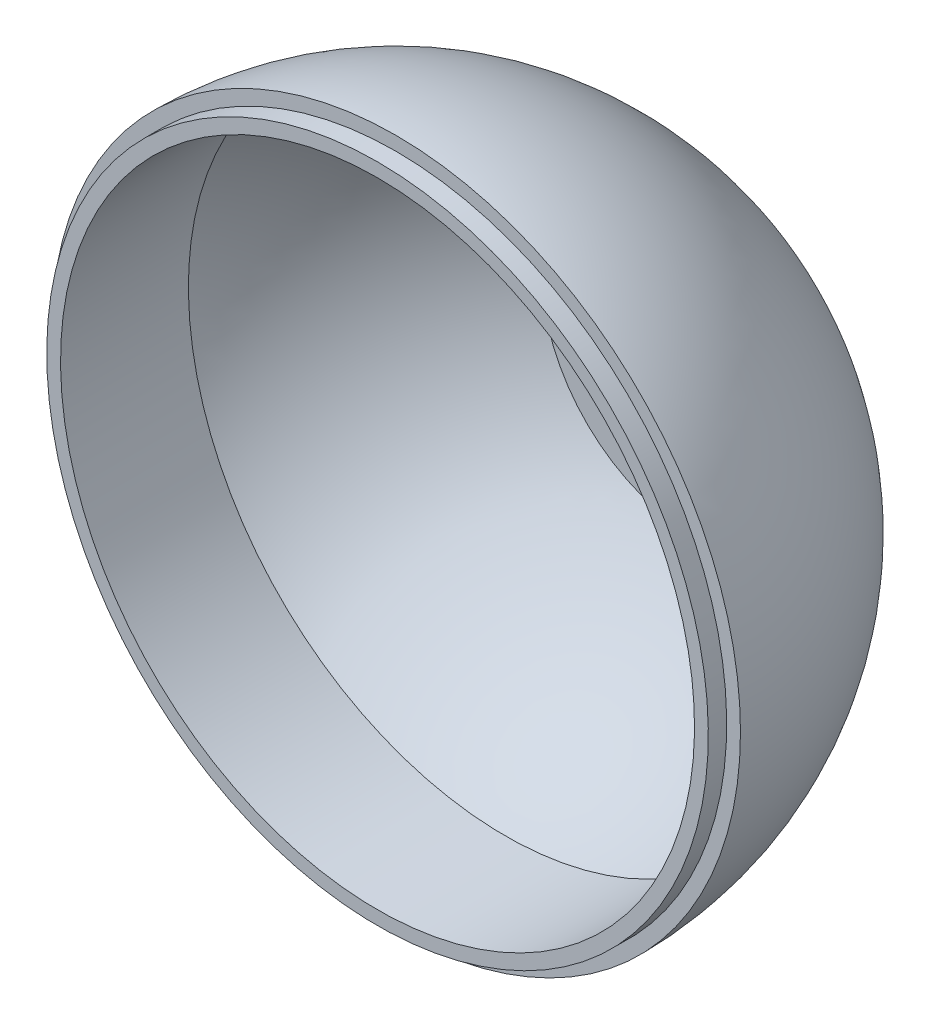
ISO-10303-21;
HEADER;
FILE_DESCRIPTION(('STEP AP214'),'2;1');
FILE_NAME('part.step','',(''),(''),'','','');
FILE_SCHEMA(('AUTOMOTIVE_DESIGN { 1 0 10303 214 1 1 1 1 }'));
ENDSEC;
DATA;
#1=APPLICATION_CONTEXT('core data for automotive mechanical design processes');
#2=APPLICATION_PROTOCOL_DEFINITION('international standard','automotive_design',2000,#1);
#3=PRODUCT_CONTEXT('',#1,'mechanical');
#4=PRODUCT('Part','Part','',(#3));
#5=PRODUCT_RELATED_PRODUCT_CATEGORY('part','',(#4));
#6=PRODUCT_DEFINITION_FORMATION('','',#4);
#7=PRODUCT_DEFINITION_CONTEXT('part definition',#1,'design');
#8=PRODUCT_DEFINITION('design','',#6,#7);
#9=PRODUCT_DEFINITION_SHAPE('','',#8);
#10=(LENGTH_UNIT() NAMED_UNIT(*) SI_UNIT(.MILLI.,.METRE.));
#11=(NAMED_UNIT(*) PLANE_ANGLE_UNIT() SI_UNIT($,.RADIAN.));
#12=(NAMED_UNIT(*) SI_UNIT($,.STERADIAN.) SOLID_ANGLE_UNIT());
#13=UNCERTAINTY_MEASURE_WITH_UNIT(LENGTH_MEASURE(1.E-05),#10,'distance_accuracy_value','');
#14=(GEOMETRIC_REPRESENTATION_CONTEXT(3) GLOBAL_UNCERTAINTY_ASSIGNED_CONTEXT((#13)) GLOBAL_UNIT_ASSIGNED_CONTEXT((#10,
#11,#12)) REPRESENTATION_CONTEXT('',''));
#15=CARTESIAN_POINT('',(0.,0.,0.));
#16=DIRECTION('',(0.,0.,1.));
#17=DIRECTION('',(1.,0.,0.));
#18=AXIS2_PLACEMENT_3D('',#15,#16,#17);
#19=CARTESIAN_POINT('',(0.,0.,-133.001519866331));
#20=DIRECTION('',(0.,0.,-1.));
#21=DIRECTION('',(1.,0.,0.));
#22=AXIS2_PLACEMENT_3D('',#19,#20,#21);
#23=CONICAL_SURFACE('',#22,1.66175,1.02974425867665);
#24=CARTESIAN_POINT('',(0.,0.,-134.));
#25=DIRECTION('',(0.,0.,1.));
#26=DIRECTION('',(1.,0.,0.));
#27=AXIS2_PLACEMENT_3D('',#24,#25,#26);
#28=CIRCLE('',#27,3.3235);
#29=CARTESIAN_POINT('',(3.3235,0.,-134.));
#30=VERTEX_POINT('',#29);
#31=EDGE_CURVE('E10',#30,#30,#28,.T.);
#32=ORIENTED_EDGE('',*,*,#31,.F.);
#33=EDGE_LOOP('',(#32));
#34=FACE_BOUND('',#33,.T.);
#35=CARTESIAN_POINT('',(0.,0.,-132.003039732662));
#36=VERTEX_POINT('',#35);
#37=VERTEX_LOOP('',#36);
#38=FACE_BOUND('',#37,.T.);
#39=ADVANCED_FACE('F15',(#34,#38),#23,.F.);
#40=CARTESIAN_POINT('',(0.,0.,-142.));
#41=DIRECTION('',(0.,0.,-1.));
#42=DIRECTION('',(1.,0.,0.));
#43=AXIS2_PLACEMENT_3D('',#40,#41,#42);
#44=CYLINDRICAL_SURFACE('',#43,3.3235);
#45=CARTESIAN_POINT('',(0.,0.,-149.9631766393));
#46=DIRECTION('',(0.,0.,1.));
#47=DIRECTION('',(1.,0.,0.));
#48=AXIS2_PLACEMENT_3D('',#45,#46,#47);
#49=CIRCLE('',#48,3.3235);
#50=CARTESIAN_POINT('',(-3.3235,0.,-149.9631766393));
#51=VERTEX_POINT('',#50);
#52=EDGE_CURVE('E61',#51,#51,#49,.T.);
#53=ORIENTED_EDGE('',*,*,#52,.F.);
#54=EDGE_LOOP('',(#53));
#55=FACE_BOUND('',#54,.T.);
#56=ORIENTED_EDGE('',*,*,#31,.T.);
#57=EDGE_LOOP('',(#56));
#58=FACE_BOUND('',#57,.T.);
#59=ADVANCED_FACE('F96',(#55,#58),#44,.F.);
#60=CARTESIAN_POINT('',(0.,66.4529909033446,-130.));
#61=DIRECTION('',(0.,0.,1.));
#62=DIRECTION('',(1.,0.,0.));
#63=AXIS2_PLACEMENT_3D('',#60,#61,#62);
#64=PLANE('',#63);
#65=CARTESIAN_POINT('',(0.,0.,-130.));
#66=DIRECTION('',(0.,0.,-1.));
#67=DIRECTION('',(1.,0.,0.));
#68=AXIS2_PLACEMENT_3D('',#65,#66,#67);
#69=CIRCLE('',#68,66.4529909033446);
#70=CARTESIAN_POINT('',(0.,66.4529909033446,-130.));
#71=VERTEX_POINT('',#70);
#72=EDGE_CURVE('E19',#71,#71,#69,.T.);
#73=ORIENTED_EDGE('',*,*,#72,.F.);
#74=EDGE_LOOP('',(#73));
#75=FACE_BOUND('',#74,.T.);
#76=ADVANCED_FACE('F102',(#75),#64,.T.);
#77=CARTESIAN_POINT('',(0.,0.,0.));
#78=DIRECTION('',(0.,0.,1.));
#79=DIRECTION('',(1.,0.,0.));
#80=AXIS2_PLACEMENT_3D('',#77,#78,#79);
#81=SPHERICAL_SURFACE('',#80,146.);
#82=CARTESIAN_POINT('',(0.,0.,-47.665501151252));
#83=DIRECTION('',(0.,0.,-1.));
#84=DIRECTION('',(1.,0.,0.));
#85=AXIS2_PLACEMENT_3D('',#82,#83,#84);
#86=CIRCLE('',#85,138.);
#87=CARTESIAN_POINT('',(0.,138.,-47.665501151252));
#88=VERTEX_POINT('',#87);
#89=EDGE_CURVE('E76',#88,#88,#86,.T.);
#90=ORIENTED_EDGE('',*,*,#89,.F.);
#91=EDGE_LOOP('',(#90));
#92=FACE_BOUND('',#91,.T.);
#93=ORIENTED_EDGE('',*,*,#72,.T.);
#94=EDGE_LOOP('',(#93));
#95=FACE_BOUND('',#94,.T.);
#96=ADVANCED_FACE('F17',(#92,#95),#81,.F.);
#97=CARTESIAN_POINT('',(0.,0.,-19.8327505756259));
#98=DIRECTION('',(0.,0.,1.));
#99=DIRECTION('',(0.,1.,0.));
#100=AXIS2_PLACEMENT_3D('',#97,#98,#99);
#101=CYLINDRICAL_SURFACE('',#100,138.);
#102=CARTESIAN_POINT('',(0.,0.,8.00000000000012));
#103=DIRECTION('',(0.,0.,-1.));
#104=DIRECTION('',(1.,0.,0.));
#105=AXIS2_PLACEMENT_3D('',#102,#103,#104);
#106=CIRCLE('',#105,138.);
#107=CARTESIAN_POINT('',(0.,138.,8.00000000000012));
#108=VERTEX_POINT('',#107);
#109=EDGE_CURVE('E72',#108,#108,#106,.T.);
#110=ORIENTED_EDGE('',*,*,#109,.F.);
#111=EDGE_LOOP('',(#110));
#112=FACE_BOUND('',#111,.T.);
#113=ORIENTED_EDGE('',*,*,#89,.T.);
#114=EDGE_LOOP('',(#113));
#115=FACE_BOUND('',#114,.T.);
#116=ADVANCED_FACE('F109',(#112,#115),#101,.F.);
#117=CARTESIAN_POINT('',(0.,144.,8.00000000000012));
#118=DIRECTION('',(0.,0.,1.));
#119=DIRECTION('',(1.,0.,0.));
#120=AXIS2_PLACEMENT_3D('',#117,#118,#119);
#121=PLANE('',#120);
#122=CARTESIAN_POINT('',(0.,0.,8.00000000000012));
#123=DIRECTION('',(0.,0.,-1.));
#124=DIRECTION('',(1.,0.,0.));
#125=AXIS2_PLACEMENT_3D('',#122,#123,#124);
#126=CIRCLE('',#125,144.);
#127=CARTESIAN_POINT('',(0.,144.,8.00000000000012));
#128=VERTEX_POINT('',#127);
#129=EDGE_CURVE('E69',#128,#128,#126,.T.);
#130=ORIENTED_EDGE('',*,*,#129,.F.);
#131=EDGE_LOOP('',(#130));
#132=FACE_BOUND('',#131,.T.);
#133=ORIENTED_EDGE('',*,*,#109,.T.);
#134=EDGE_LOOP('',(#133));
#135=FACE_BOUND('',#134,.T.);
#136=ADVANCED_FACE('F93',(#132,#135),#121,.T.);
#137=CARTESIAN_POINT('',(0.,0.,4.00000000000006));
#138=DIRECTION('',(0.,0.,1.));
#139=DIRECTION('',(0.,1.,0.));
#140=AXIS2_PLACEMENT_3D('',#137,#138,#139);
#141=CYLINDRICAL_SURFACE('',#140,144.);
#142=CARTESIAN_POINT('',(0.,0.,0.));
#143=DIRECTION('',(0.,0.,-1.));
#144=DIRECTION('',(1.,0.,0.));
#145=AXIS2_PLACEMENT_3D('',#142,#143,#144);
#146=CIRCLE('',#145,144.);
#147=CARTESIAN_POINT('',(0.,144.,0.));
#148=VERTEX_POINT('',#147);
#149=EDGE_CURVE('E52',#148,#148,#146,.T.);
#150=ORIENTED_EDGE('',*,*,#149,.F.);
#151=EDGE_LOOP('',(#150));
#152=FACE_BOUND('',#151,.T.);
#153=ORIENTED_EDGE('',*,*,#129,.T.);
#154=EDGE_LOOP('',(#153));
#155=FACE_BOUND('',#154,.T.);
#156=ADVANCED_FACE('F84',(#152,#155),#141,.T.);
#157=CARTESIAN_POINT('',(0.,150.,0.));
#158=DIRECTION('',(0.,0.,1.));
#159=DIRECTION('',(1.,0.,0.));
#160=AXIS2_PLACEMENT_3D('',#157,#158,#159);
#161=PLANE('',#160);
#162=CARTESIAN_POINT('',(0.,0.,0.));
#163=DIRECTION('',(0.,0.,-1.));
#164=DIRECTION('',(1.,0.,0.));
#165=AXIS2_PLACEMENT_3D('',#162,#163,#164);
#166=CIRCLE('',#165,150.);
#167=CARTESIAN_POINT('',(0.,150.,0.));
#168=VERTEX_POINT('',#167);
#169=EDGE_CURVE('E56',#168,#168,#166,.T.);
#170=ORIENTED_EDGE('',*,*,#169,.F.);
#171=EDGE_LOOP('',(#170));
#172=FACE_BOUND('',#171,.T.);
#173=ORIENTED_EDGE('',*,*,#149,.T.);
#174=EDGE_LOOP('',(#173));
#175=FACE_BOUND('',#174,.T.);
#176=ADVANCED_FACE('F57',(#172,#175),#161,.T.);
#177=CARTESIAN_POINT('',(0.,0.,0.));
#178=DIRECTION('',(0.,0.,1.));
#179=DIRECTION('',(1.,0.,0.));
#180=AXIS2_PLACEMENT_3D('',#177,#178,#179);
#181=SPHERICAL_SURFACE('',#180,150.);
#182=ORIENTED_EDGE('',*,*,#52,.T.);
#183=EDGE_LOOP('',(#182));
#184=FACE_BOUND('',#183,.T.);
#185=ORIENTED_EDGE('',*,*,#169,.T.);
#186=EDGE_LOOP('',(#185));
#187=FACE_BOUND('',#186,.T.);
#188=ADVANCED_FACE('F83',(#184,#187),#181,.T.);
#189=CLOSED_SHELL('',(#39,#59,#76,#96,#116,#136,#156,#176,#188));
#190=MANIFOLD_SOLID_BREP('B1',#189);
#191=ADVANCED_BREP_SHAPE_REPRESENTATION('',(#18,#190),#14);
#192=SHAPE_DEFINITION_REPRESENTATION(#9,#191);
ENDSEC;
END-ISO-10303-21;
